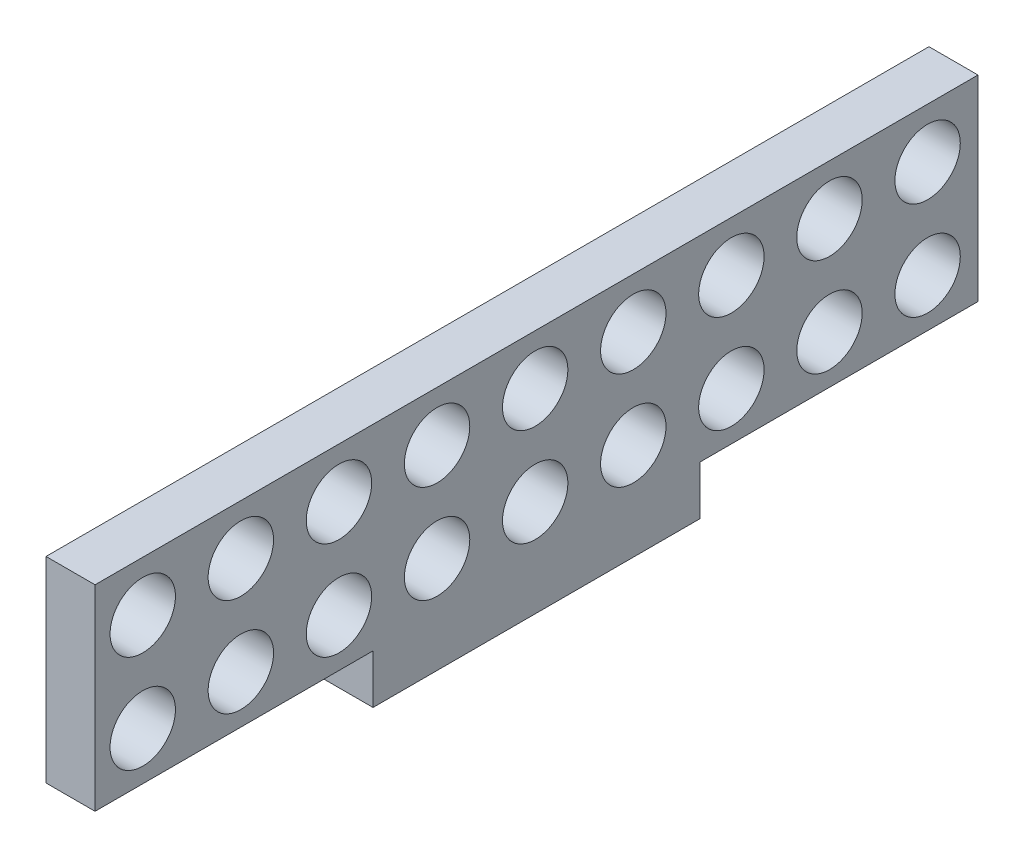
ISO-10303-21;
HEADER;
FILE_DESCRIPTION(('STEP AP214'),'2;1');
FILE_NAME('part.step','',(''),(''),'','','');
FILE_SCHEMA(('AUTOMOTIVE_DESIGN { 1 0 10303 214 1 1 1 1 }'));
ENDSEC;
DATA;
#1=APPLICATION_CONTEXT('core data for automotive mechanical design processes');
#2=APPLICATION_PROTOCOL_DEFINITION('international standard','automotive_design',2000,#1);
#3=PRODUCT_CONTEXT('',#1,'mechanical');
#4=PRODUCT('Part','Part','',(#3));
#5=PRODUCT_RELATED_PRODUCT_CATEGORY('part','',(#4));
#6=PRODUCT_DEFINITION_FORMATION('','',#4);
#7=PRODUCT_DEFINITION_CONTEXT('part definition',#1,'design');
#8=PRODUCT_DEFINITION('design','',#6,#7);
#9=PRODUCT_DEFINITION_SHAPE('','',#8);
#10=(LENGTH_UNIT() NAMED_UNIT(*) SI_UNIT(.MILLI.,.METRE.));
#11=(NAMED_UNIT(*) PLANE_ANGLE_UNIT() SI_UNIT($,.RADIAN.));
#12=(NAMED_UNIT(*) SI_UNIT($,.STERADIAN.) SOLID_ANGLE_UNIT());
#13=UNCERTAINTY_MEASURE_WITH_UNIT(LENGTH_MEASURE(1.E-05),#10,'distance_accuracy_value','');
#14=(GEOMETRIC_REPRESENTATION_CONTEXT(3) GLOBAL_UNCERTAINTY_ASSIGNED_CONTEXT((#13)) GLOBAL_UNIT_ASSIGNED_CONTEXT((#10,
#11,#12)) REPRESENTATION_CONTEXT('',''));
#15=CARTESIAN_POINT('',(0.,0.,0.));
#16=DIRECTION('',(0.,0.,1.));
#17=DIRECTION('',(1.,0.,0.));
#18=AXIS2_PLACEMENT_3D('',#15,#16,#17);
#19=CARTESIAN_POINT('',(3.,7.94312425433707,32.3960362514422));
#20=DIRECTION('',(1.,0.,0.));
#21=DIRECTION('',(0.,0.,-1.));
#22=AXIS2_PLACEMENT_3D('',#19,#20,#21);
#23=PLANE('',#22);
#24=CARTESIAN_POINT('',(3.,4.87641659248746,77.4786925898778));
#25=DIRECTION('',(1.,0.,0.));
#26=DIRECTION('',(0.,0.,-1.));
#27=AXIS2_PLACEMENT_3D('',#24,#25,#26);
#28=CIRCLE('',#27,2.);
#29=CARTESIAN_POINT('',(3.,4.87641659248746,75.4786925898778));
#30=VERTEX_POINT('',#29);
#31=EDGE_CURVE('E272',#30,#30,#28,.T.);
#32=ORIENTED_EDGE('',*,*,#31,.F.);
#33=EDGE_LOOP('',(#32));
#34=FACE_BOUND('',#33,.T.);
#35=CARTESIAN_POINT('',(3.,4.87641659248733,65.4786925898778));
#36=DIRECTION('',(1.,0.,0.));
#37=DIRECTION('',(0.,0.,-1.));
#38=AXIS2_PLACEMENT_3D('',#35,#36,#37);
#39=CIRCLE('',#38,2.);
#40=CARTESIAN_POINT('',(3.,4.87641659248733,63.4786925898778));
#41=VERTEX_POINT('',#40);
#42=EDGE_CURVE('E260',#41,#41,#39,.T.);
#43=ORIENTED_EDGE('',*,*,#42,.F.);
#44=EDGE_LOOP('',(#43));
#45=FACE_BOUND('',#44,.T.);
#46=CARTESIAN_POINT('',(3.,4.87641659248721,53.4786925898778));
#47=DIRECTION('',(1.,0.,0.));
#48=DIRECTION('',(0.,0.,-1.));
#49=AXIS2_PLACEMENT_3D('',#46,#47,#48);
#50=CIRCLE('',#49,2.);
#51=CARTESIAN_POINT('',(3.,4.87641659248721,51.4786925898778));
#52=VERTEX_POINT('',#51);
#53=EDGE_CURVE('E248',#52,#52,#50,.T.);
#54=ORIENTED_EDGE('',*,*,#53,.F.);
#55=EDGE_LOOP('',(#54));
#56=FACE_BOUND('',#55,.T.);
#57=CARTESIAN_POINT('',(3.,4.87641659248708,41.4786925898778));
#58=DIRECTION('',(1.,0.,0.));
#59=DIRECTION('',(0.,0.,-1.));
#60=AXIS2_PLACEMENT_3D('',#57,#58,#59);
#61=CIRCLE('',#60,2.);
#62=CARTESIAN_POINT('',(3.,4.87641659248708,39.4786925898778));
#63=VERTEX_POINT('',#62);
#64=EDGE_CURVE('E236',#63,#63,#61,.T.);
#65=ORIENTED_EDGE('',*,*,#64,.F.);
#66=EDGE_LOOP('',(#65));
#67=FACE_BOUND('',#66,.T.);
#68=CARTESIAN_POINT('',(3.,-1.12358340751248,83.4786925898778));
#69=DIRECTION('',(1.,0.,0.));
#70=DIRECTION('',(0.,0.,-1.));
#71=AXIS2_PLACEMENT_3D('',#68,#69,#70);
#72=CIRCLE('',#71,2.);
#73=CARTESIAN_POINT('',(3.,-1.12358340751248,81.4786925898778));
#74=VERTEX_POINT('',#73);
#75=EDGE_CURVE('E224',#74,#74,#72,.T.);
#76=ORIENTED_EDGE('',*,*,#75,.F.);
#77=EDGE_LOOP('',(#76));
#78=FACE_BOUND('',#77,.T.);
#79=CARTESIAN_POINT('',(3.,-1.12358340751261,71.4786925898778));
#80=DIRECTION('',(1.,0.,0.));
#81=DIRECTION('',(0.,0.,-1.));
#82=AXIS2_PLACEMENT_3D('',#79,#80,#81);
#83=CIRCLE('',#82,2.);
#84=CARTESIAN_POINT('',(3.,-1.12358340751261,69.4786925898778));
#85=VERTEX_POINT('',#84);
#86=EDGE_CURVE('E212',#85,#85,#83,.T.);
#87=ORIENTED_EDGE('',*,*,#86,.F.);
#88=EDGE_LOOP('',(#87));
#89=FACE_BOUND('',#88,.T.);
#90=CARTESIAN_POINT('',(3.,-1.12358340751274,59.4786925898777));
#91=DIRECTION('',(1.,0.,0.));
#92=DIRECTION('',(0.,0.,-1.));
#93=AXIS2_PLACEMENT_3D('',#90,#91,#92);
#94=CIRCLE('',#93,2.);
#95=CARTESIAN_POINT('',(3.,-1.12358340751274,57.4786925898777));
#96=VERTEX_POINT('',#95);
#97=EDGE_CURVE('E200',#96,#96,#94,.T.);
#98=ORIENTED_EDGE('',*,*,#97,.F.);
#99=EDGE_LOOP('',(#98));
#100=FACE_BOUND('',#99,.T.);
#101=CARTESIAN_POINT('',(3.,-1.12358340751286,47.4786925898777));
#102=DIRECTION('',(1.,0.,0.));
#103=DIRECTION('',(0.,0.,-1.));
#104=AXIS2_PLACEMENT_3D('',#101,#102,#103);
#105=CIRCLE('',#104,2.);
#106=CARTESIAN_POINT('',(3.,-1.12358340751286,45.4786925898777));
#107=VERTEX_POINT('',#106);
#108=EDGE_CURVE('E188',#107,#107,#105,.T.);
#109=ORIENTED_EDGE('',*,*,#108,.F.);
#110=EDGE_LOOP('',(#109));
#111=FACE_BOUND('',#110,.T.);
#112=CARTESIAN_POINT('',(3.,-1.12358340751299,35.4786925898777));
#113=DIRECTION('',(1.,0.,0.));
#114=DIRECTION('',(0.,0.,-1.));
#115=AXIS2_PLACEMENT_3D('',#112,#113,#114);
#116=CIRCLE('',#115,2.);
#117=CARTESIAN_POINT('',(3.,-1.12358340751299,33.4786925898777));
#118=VERTEX_POINT('',#117);
#119=EDGE_CURVE('E134',#118,#118,#116,.T.);
#120=ORIENTED_EDGE('',*,*,#119,.F.);
#121=EDGE_LOOP('',(#120));
#122=FACE_BOUND('',#121,.T.);
#123=DIRECTION('',(0.,1.,0.));
#124=VECTOR('',#123,1.);
#125=CARTESIAN_POINT('',(3.,-4.05687574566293,32.3960362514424));
#126=LINE('',#125,#124);
#127=CARTESIAN_POINT('',(3.,-4.05687574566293,32.3960362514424));
#128=VERTEX_POINT('',#127);
#129=CARTESIAN_POINT('',(3.,7.94312425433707,32.3960362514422));
#130=VERTEX_POINT('',#129);
#131=EDGE_CURVE('E145',#128,#130,#126,.T.);
#132=ORIENTED_EDGE('',*,*,#131,.T.);
#133=DIRECTION('',(0.,0.,1.));
#134=VECTOR('',#133,1.);
#135=CARTESIAN_POINT('',(3.,7.94312425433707,32.3960362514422));
#136=LINE('',#135,#134);
#137=CARTESIAN_POINT('',(3.,7.94312425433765,86.3960362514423));
#138=VERTEX_POINT('',#137);
#139=EDGE_CURVE('E93',#130,#138,#136,.T.);
#140=ORIENTED_EDGE('',*,*,#139,.T.);
#141=DIRECTION('',(0.,-1.,0.));
#142=VECTOR('',#141,1.);
#143=CARTESIAN_POINT('',(3.,-4.05687574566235,86.3960362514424));
#144=LINE('',#143,#142);
#145=CARTESIAN_POINT('',(3.,-4.05687574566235,86.3960362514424));
#146=VERTEX_POINT('',#145);
#147=EDGE_CURVE('E160',#138,#146,#144,.T.);
#148=ORIENTED_EDGE('',*,*,#147,.T.);
#149=DIRECTION('',(0.,0.,-1.));
#150=VECTOR('',#149,1.);
#151=CARTESIAN_POINT('',(3.,-4.05687574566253,69.3960362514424));
#152=LINE('',#151,#150);
#153=CARTESIAN_POINT('',(3.,-4.05687574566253,69.3960362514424));
#154=VERTEX_POINT('',#153);
#155=EDGE_CURVE('E173',#146,#154,#152,.T.);
#156=ORIENTED_EDGE('',*,*,#155,.T.);
#157=DIRECTION('',(0.,-1.,0.));
#158=VECTOR('',#157,1.);
#159=CARTESIAN_POINT('',(3.,-7.05687574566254,69.3960362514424));
#160=LINE('',#159,#158);
#161=CARTESIAN_POINT('',(3.,-7.05687574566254,69.3960362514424));
#162=VERTEX_POINT('',#161);
#163=EDGE_CURVE('E112',#154,#162,#160,.T.);
#164=ORIENTED_EDGE('',*,*,#163,.T.);
#165=DIRECTION('',(0.,0.,-1.));
#166=VECTOR('',#165,1.);
#167=CARTESIAN_POINT('',(3.,-7.05687574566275,49.3960362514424));
#168=LINE('',#167,#166);
#169=CARTESIAN_POINT('',(3.,-7.05687574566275,49.3960362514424));
#170=VERTEX_POINT('',#169);
#171=EDGE_CURVE('E106',#162,#170,#168,.T.);
#172=ORIENTED_EDGE('',*,*,#171,.T.);
#173=DIRECTION('',(0.,1.,0.));
#174=VECTOR('',#173,1.);
#175=CARTESIAN_POINT('',(3.,-7.05687574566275,49.3960362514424));
#176=LINE('',#175,#174);
#177=CARTESIAN_POINT('',(3.,-4.05687574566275,49.3960362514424));
#178=VERTEX_POINT('',#177);
#179=EDGE_CURVE('E110',#170,#178,#176,.T.);
#180=ORIENTED_EDGE('',*,*,#179,.T.);
#181=DIRECTION('',(0.,0.,-1.));
#182=VECTOR('',#181,1.);
#183=CARTESIAN_POINT('',(3.,-4.05687574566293,32.3960362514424));
#184=LINE('',#183,#182);
#185=EDGE_CURVE('E50',#178,#128,#184,.T.);
#186=ORIENTED_EDGE('',*,*,#185,.T.);
#187=EDGE_LOOP('',(#132,#140,#148,#156,#164,#172,#180,#186));
#188=FACE_BOUND('',#187,.T.);
#189=CARTESIAN_POINT('',(3.,-1.12358340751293,41.4786925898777));
#190=DIRECTION('',(1.,0.,0.));
#191=DIRECTION('',(0.,0.,-1.));
#192=AXIS2_PLACEMENT_3D('',#189,#190,#191);
#193=CIRCLE('',#192,2.);
#194=CARTESIAN_POINT('',(3.,-1.12358340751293,39.4786925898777));
#195=VERTEX_POINT('',#194);
#196=EDGE_CURVE('E182',#195,#195,#193,.T.);
#197=ORIENTED_EDGE('',*,*,#196,.F.);
#198=EDGE_LOOP('',(#197));
#199=FACE_BOUND('',#198,.T.);
#200=CARTESIAN_POINT('',(3.,-1.1235834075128,53.4786925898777));
#201=DIRECTION('',(1.,0.,0.));
#202=DIRECTION('',(0.,0.,-1.));
#203=AXIS2_PLACEMENT_3D('',#200,#201,#202);
#204=CIRCLE('',#203,2.);
#205=CARTESIAN_POINT('',(3.,-1.1235834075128,51.4786925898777));
#206=VERTEX_POINT('',#205);
#207=EDGE_CURVE('E194',#206,#206,#204,.T.);
#208=ORIENTED_EDGE('',*,*,#207,.F.);
#209=EDGE_LOOP('',(#208));
#210=FACE_BOUND('',#209,.T.);
#211=CARTESIAN_POINT('',(3.,-1.12358340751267,65.4786925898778));
#212=DIRECTION('',(1.,0.,0.));
#213=DIRECTION('',(0.,0.,-1.));
#214=AXIS2_PLACEMENT_3D('',#211,#212,#213);
#215=CIRCLE('',#214,2.);
#216=CARTESIAN_POINT('',(3.,-1.12358340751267,63.4786925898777));
#217=VERTEX_POINT('',#216);
#218=EDGE_CURVE('E206',#217,#217,#215,.T.);
#219=ORIENTED_EDGE('',*,*,#218,.F.);
#220=EDGE_LOOP('',(#219));
#221=FACE_BOUND('',#220,.T.);
#222=CARTESIAN_POINT('',(3.,-1.12358340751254,77.4786925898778));
#223=DIRECTION('',(1.,0.,0.));
#224=DIRECTION('',(0.,0.,-1.));
#225=AXIS2_PLACEMENT_3D('',#222,#223,#224);
#226=CIRCLE('',#225,2.);
#227=CARTESIAN_POINT('',(3.,-1.12358340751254,75.4786925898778));
#228=VERTEX_POINT('',#227);
#229=EDGE_CURVE('E218',#228,#228,#226,.T.);
#230=ORIENTED_EDGE('',*,*,#229,.F.);
#231=EDGE_LOOP('',(#230));
#232=FACE_BOUND('',#231,.T.);
#233=CARTESIAN_POINT('',(3.,4.87641659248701,35.4786925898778));
#234=DIRECTION('',(1.,0.,0.));
#235=DIRECTION('',(0.,0.,-1.));
#236=AXIS2_PLACEMENT_3D('',#233,#234,#235);
#237=CIRCLE('',#236,2.);
#238=CARTESIAN_POINT('',(3.,4.87641659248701,33.4786925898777));
#239=VERTEX_POINT('',#238);
#240=EDGE_CURVE('E230',#239,#239,#237,.T.);
#241=ORIENTED_EDGE('',*,*,#240,.F.);
#242=EDGE_LOOP('',(#241));
#243=FACE_BOUND('',#242,.T.);
#244=CARTESIAN_POINT('',(3.,4.87641659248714,47.4786925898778));
#245=DIRECTION('',(1.,0.,0.));
#246=DIRECTION('',(0.,0.,-1.));
#247=AXIS2_PLACEMENT_3D('',#244,#245,#246);
#248=CIRCLE('',#247,2.);
#249=CARTESIAN_POINT('',(3.,4.87641659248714,45.4786925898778));
#250=VERTEX_POINT('',#249);
#251=EDGE_CURVE('E242',#250,#250,#248,.T.);
#252=ORIENTED_EDGE('',*,*,#251,.F.);
#253=EDGE_LOOP('',(#252));
#254=FACE_BOUND('',#253,.T.);
#255=CARTESIAN_POINT('',(3.,4.87641659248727,59.4786925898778));
#256=DIRECTION('',(1.,0.,0.));
#257=DIRECTION('',(0.,0.,-1.));
#258=AXIS2_PLACEMENT_3D('',#255,#256,#257);
#259=CIRCLE('',#258,2.);
#260=CARTESIAN_POINT('',(3.,4.87641659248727,57.4786925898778));
#261=VERTEX_POINT('',#260);
#262=EDGE_CURVE('E254',#261,#261,#259,.T.);
#263=ORIENTED_EDGE('',*,*,#262,.F.);
#264=EDGE_LOOP('',(#263));
#265=FACE_BOUND('',#264,.T.);
#266=CARTESIAN_POINT('',(3.,4.8764165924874,71.4786925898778));
#267=DIRECTION('',(1.,0.,0.));
#268=DIRECTION('',(0.,0.,-1.));
#269=AXIS2_PLACEMENT_3D('',#266,#267,#268);
#270=CIRCLE('',#269,2.);
#271=CARTESIAN_POINT('',(3.,4.8764165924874,69.4786925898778));
#272=VERTEX_POINT('',#271);
#273=EDGE_CURVE('E266',#272,#272,#270,.T.);
#274=ORIENTED_EDGE('',*,*,#273,.F.);
#275=EDGE_LOOP('',(#274));
#276=FACE_BOUND('',#275,.T.);
#277=CARTESIAN_POINT('',(3.,4.87641659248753,83.4786925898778));
#278=DIRECTION('',(1.,0.,0.));
#279=DIRECTION('',(0.,0.,-1.));
#280=AXIS2_PLACEMENT_3D('',#277,#278,#279);
#281=CIRCLE('',#280,2.);
#282=CARTESIAN_POINT('',(3.,4.87641659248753,81.4786925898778));
#283=VERTEX_POINT('',#282);
#284=EDGE_CURVE('E278',#283,#283,#281,.T.);
#285=ORIENTED_EDGE('',*,*,#284,.F.);
#286=EDGE_LOOP('',(#285));
#287=FACE_BOUND('',#286,.T.);
#288=ADVANCED_FACE('F33',(#34,#45,#56,#67,#78,#89,#100,#111,#122,#188,#199,#210,#221,#232,#243,
#254,#265,#276,#287),#23,.T.);
#289=CARTESIAN_POINT('',(0.,7.94312425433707,32.3960362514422));
#290=DIRECTION('',(1.,0.,0.));
#291=DIRECTION('',(0.,0.,-1.));
#292=AXIS2_PLACEMENT_3D('',#289,#290,#291);
#293=PLANE('',#292);
#294=CARTESIAN_POINT('',(0.,4.87641659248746,77.4786925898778));
#295=DIRECTION('',(1.,0.,0.));
#296=DIRECTION('',(0.,0.,-1.));
#297=AXIS2_PLACEMENT_3D('',#294,#295,#296);
#298=CIRCLE('',#297,2.);
#299=CARTESIAN_POINT('',(0.,4.87641659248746,75.4786925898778));
#300=VERTEX_POINT('',#299);
#301=EDGE_CURVE('E275',#300,#300,#298,.T.);
#302=ORIENTED_EDGE('',*,*,#301,.T.);
#303=EDGE_LOOP('',(#302));
#304=FACE_BOUND('',#303,.T.);
#305=CARTESIAN_POINT('',(0.,4.87641659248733,65.4786925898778));
#306=DIRECTION('',(1.,0.,0.));
#307=DIRECTION('',(0.,0.,-1.));
#308=AXIS2_PLACEMENT_3D('',#305,#306,#307);
#309=CIRCLE('',#308,2.);
#310=CARTESIAN_POINT('',(0.,4.87641659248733,63.4786925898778));
#311=VERTEX_POINT('',#310);
#312=EDGE_CURVE('E263',#311,#311,#309,.T.);
#313=ORIENTED_EDGE('',*,*,#312,.T.);
#314=EDGE_LOOP('',(#313));
#315=FACE_BOUND('',#314,.T.);
#316=CARTESIAN_POINT('',(0.,4.87641659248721,53.4786925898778));
#317=DIRECTION('',(1.,0.,0.));
#318=DIRECTION('',(0.,0.,-1.));
#319=AXIS2_PLACEMENT_3D('',#316,#317,#318);
#320=CIRCLE('',#319,2.);
#321=CARTESIAN_POINT('',(0.,4.87641659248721,51.4786925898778));
#322=VERTEX_POINT('',#321);
#323=EDGE_CURVE('E251',#322,#322,#320,.T.);
#324=ORIENTED_EDGE('',*,*,#323,.T.);
#325=EDGE_LOOP('',(#324));
#326=FACE_BOUND('',#325,.T.);
#327=CARTESIAN_POINT('',(0.,4.87641659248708,41.4786925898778));
#328=DIRECTION('',(1.,0.,0.));
#329=DIRECTION('',(0.,0.,-1.));
#330=AXIS2_PLACEMENT_3D('',#327,#328,#329);
#331=CIRCLE('',#330,2.);
#332=CARTESIAN_POINT('',(0.,4.87641659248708,39.4786925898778));
#333=VERTEX_POINT('',#332);
#334=EDGE_CURVE('E239',#333,#333,#331,.T.);
#335=ORIENTED_EDGE('',*,*,#334,.T.);
#336=EDGE_LOOP('',(#335));
#337=FACE_BOUND('',#336,.T.);
#338=CARTESIAN_POINT('',(0.,-1.12358340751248,83.4786925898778));
#339=DIRECTION('',(1.,0.,0.));
#340=DIRECTION('',(0.,0.,-1.));
#341=AXIS2_PLACEMENT_3D('',#338,#339,#340);
#342=CIRCLE('',#341,2.);
#343=CARTESIAN_POINT('',(0.,-1.12358340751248,81.4786925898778));
#344=VERTEX_POINT('',#343);
#345=EDGE_CURVE('E227',#344,#344,#342,.T.);
#346=ORIENTED_EDGE('',*,*,#345,.T.);
#347=EDGE_LOOP('',(#346));
#348=FACE_BOUND('',#347,.T.);
#349=CARTESIAN_POINT('',(0.,-1.12358340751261,71.4786925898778));
#350=DIRECTION('',(1.,0.,0.));
#351=DIRECTION('',(0.,0.,-1.));
#352=AXIS2_PLACEMENT_3D('',#349,#350,#351);
#353=CIRCLE('',#352,2.);
#354=CARTESIAN_POINT('',(0.,-1.12358340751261,69.4786925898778));
#355=VERTEX_POINT('',#354);
#356=EDGE_CURVE('E215',#355,#355,#353,.T.);
#357=ORIENTED_EDGE('',*,*,#356,.T.);
#358=EDGE_LOOP('',(#357));
#359=FACE_BOUND('',#358,.T.);
#360=CARTESIAN_POINT('',(0.,-1.12358340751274,59.4786925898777));
#361=DIRECTION('',(1.,0.,0.));
#362=DIRECTION('',(0.,0.,-1.));
#363=AXIS2_PLACEMENT_3D('',#360,#361,#362);
#364=CIRCLE('',#363,2.);
#365=CARTESIAN_POINT('',(0.,-1.12358340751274,57.4786925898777));
#366=VERTEX_POINT('',#365);
#367=EDGE_CURVE('E203',#366,#366,#364,.T.);
#368=ORIENTED_EDGE('',*,*,#367,.T.);
#369=EDGE_LOOP('',(#368));
#370=FACE_BOUND('',#369,.T.);
#371=CARTESIAN_POINT('',(0.,-1.12358340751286,47.4786925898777));
#372=DIRECTION('',(1.,0.,0.));
#373=DIRECTION('',(0.,0.,-1.));
#374=AXIS2_PLACEMENT_3D('',#371,#372,#373);
#375=CIRCLE('',#374,2.);
#376=CARTESIAN_POINT('',(0.,-1.12358340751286,45.4786925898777));
#377=VERTEX_POINT('',#376);
#378=EDGE_CURVE('E191',#377,#377,#375,.T.);
#379=ORIENTED_EDGE('',*,*,#378,.T.);
#380=EDGE_LOOP('',(#379));
#381=FACE_BOUND('',#380,.T.);
#382=CARTESIAN_POINT('',(0.,-1.12358340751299,35.4786925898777));
#383=DIRECTION('',(1.,0.,0.));
#384=DIRECTION('',(0.,0.,-1.));
#385=AXIS2_PLACEMENT_3D('',#382,#383,#384);
#386=CIRCLE('',#385,2.);
#387=CARTESIAN_POINT('',(0.,-1.12358340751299,33.4786925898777));
#388=VERTEX_POINT('',#387);
#389=EDGE_CURVE('E179',#388,#388,#386,.T.);
#390=ORIENTED_EDGE('',*,*,#389,.T.);
#391=EDGE_LOOP('',(#390));
#392=FACE_BOUND('',#391,.T.);
#393=DIRECTION('',(0.,1.,0.));
#394=VECTOR('',#393,1.);
#395=CARTESIAN_POINT('',(0.,-4.05687574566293,32.3960362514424));
#396=LINE('',#395,#394);
#397=CARTESIAN_POINT('',(0.,-4.05687574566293,32.3960362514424));
#398=VERTEX_POINT('',#397);
#399=CARTESIAN_POINT('',(0.,7.94312425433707,32.3960362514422));
#400=VERTEX_POINT('',#399);
#401=EDGE_CURVE('E130',#398,#400,#396,.T.);
#402=ORIENTED_EDGE('',*,*,#401,.F.);
#403=DIRECTION('',(0.,0.,-1.));
#404=VECTOR('',#403,1.);
#405=CARTESIAN_POINT('',(0.,-4.05687574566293,32.3960362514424));
#406=LINE('',#405,#404);
#407=CARTESIAN_POINT('',(0.,-4.05687574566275,49.3960362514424));
#408=VERTEX_POINT('',#407);
#409=EDGE_CURVE('E85',#408,#398,#406,.T.);
#410=ORIENTED_EDGE('',*,*,#409,.F.);
#411=DIRECTION('',(0.,1.,0.));
#412=VECTOR('',#411,1.);
#413=CARTESIAN_POINT('',(0.,-7.05687574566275,49.3960362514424));
#414=LINE('',#413,#412);
#415=CARTESIAN_POINT('',(0.,-7.05687574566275,49.3960362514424));
#416=VERTEX_POINT('',#415);
#417=EDGE_CURVE('E79',#416,#408,#414,.T.);
#418=ORIENTED_EDGE('',*,*,#417,.F.);
#419=DIRECTION('',(0.,0.,-1.));
#420=VECTOR('',#419,1.);
#421=CARTESIAN_POINT('',(0.,-7.05687574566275,49.3960362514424));
#422=LINE('',#421,#420);
#423=CARTESIAN_POINT('',(0.,-7.05687574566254,69.3960362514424));
#424=VERTEX_POINT('',#423);
#425=EDGE_CURVE('E120',#424,#416,#422,.T.);
#426=ORIENTED_EDGE('',*,*,#425,.F.);
#427=DIRECTION('',(0.,-1.,0.));
#428=VECTOR('',#427,1.);
#429=CARTESIAN_POINT('',(0.,-7.05687574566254,69.3960362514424));
#430=LINE('',#429,#428);
#431=CARTESIAN_POINT('',(0.,-4.05687574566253,69.3960362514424));
#432=VERTEX_POINT('',#431);
#433=EDGE_CURVE('E140',#432,#424,#430,.T.);
#434=ORIENTED_EDGE('',*,*,#433,.F.);
#435=DIRECTION('',(0.,0.,-1.));
#436=VECTOR('',#435,1.);
#437=CARTESIAN_POINT('',(0.,-4.05687574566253,69.3960362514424));
#438=LINE('',#437,#436);
#439=CARTESIAN_POINT('',(0.,-4.05687574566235,86.3960362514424));
#440=VERTEX_POINT('',#439);
#441=EDGE_CURVE('E138',#440,#432,#438,.T.);
#442=ORIENTED_EDGE('',*,*,#441,.F.);
#443=DIRECTION('',(0.,-1.,0.));
#444=VECTOR('',#443,1.);
#445=CARTESIAN_POINT('',(0.,-4.05687574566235,86.3960362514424));
#446=LINE('',#445,#444);
#447=CARTESIAN_POINT('',(0.,7.94312425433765,86.3960362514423));
#448=VERTEX_POINT('',#447);
#449=EDGE_CURVE('E136',#448,#440,#446,.T.);
#450=ORIENTED_EDGE('',*,*,#449,.F.);
#451=DIRECTION('',(0.,0.,1.));
#452=VECTOR('',#451,1.);
#453=CARTESIAN_POINT('',(0.,7.94312425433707,32.3960362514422));
#454=LINE('',#453,#452);
#455=EDGE_CURVE('E133',#400,#448,#454,.T.);
#456=ORIENTED_EDGE('',*,*,#455,.F.);
#457=EDGE_LOOP('',(#402,#410,#418,#426,#434,#442,#450,#456));
#458=FACE_BOUND('',#457,.T.);
#459=CARTESIAN_POINT('',(0.,-1.12358340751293,41.4786925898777));
#460=DIRECTION('',(1.,0.,0.));
#461=DIRECTION('',(0.,0.,-1.));
#462=AXIS2_PLACEMENT_3D('',#459,#460,#461);
#463=CIRCLE('',#462,2.);
#464=CARTESIAN_POINT('',(0.,-1.12358340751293,39.4786925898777));
#465=VERTEX_POINT('',#464);
#466=EDGE_CURVE('E185',#465,#465,#463,.T.);
#467=ORIENTED_EDGE('',*,*,#466,.T.);
#468=EDGE_LOOP('',(#467));
#469=FACE_BOUND('',#468,.T.);
#470=CARTESIAN_POINT('',(0.,-1.1235834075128,53.4786925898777));
#471=DIRECTION('',(1.,0.,0.));
#472=DIRECTION('',(0.,0.,-1.));
#473=AXIS2_PLACEMENT_3D('',#470,#471,#472);
#474=CIRCLE('',#473,2.);
#475=CARTESIAN_POINT('',(0.,-1.1235834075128,51.4786925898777));
#476=VERTEX_POINT('',#475);
#477=EDGE_CURVE('E197',#476,#476,#474,.T.);
#478=ORIENTED_EDGE('',*,*,#477,.T.);
#479=EDGE_LOOP('',(#478));
#480=FACE_BOUND('',#479,.T.);
#481=CARTESIAN_POINT('',(0.,-1.12358340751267,65.4786925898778));
#482=DIRECTION('',(1.,0.,0.));
#483=DIRECTION('',(0.,0.,-1.));
#484=AXIS2_PLACEMENT_3D('',#481,#482,#483);
#485=CIRCLE('',#484,2.);
#486=CARTESIAN_POINT('',(0.,-1.12358340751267,63.4786925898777));
#487=VERTEX_POINT('',#486);
#488=EDGE_CURVE('E209',#487,#487,#485,.T.);
#489=ORIENTED_EDGE('',*,*,#488,.T.);
#490=EDGE_LOOP('',(#489));
#491=FACE_BOUND('',#490,.T.);
#492=CARTESIAN_POINT('',(0.,-1.12358340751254,77.4786925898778));
#493=DIRECTION('',(1.,0.,0.));
#494=DIRECTION('',(0.,0.,-1.));
#495=AXIS2_PLACEMENT_3D('',#492,#493,#494);
#496=CIRCLE('',#495,2.);
#497=CARTESIAN_POINT('',(0.,-1.12358340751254,75.4786925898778));
#498=VERTEX_POINT('',#497);
#499=EDGE_CURVE('E221',#498,#498,#496,.T.);
#500=ORIENTED_EDGE('',*,*,#499,.T.);
#501=EDGE_LOOP('',(#500));
#502=FACE_BOUND('',#501,.T.);
#503=CARTESIAN_POINT('',(0.,4.87641659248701,35.4786925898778));
#504=DIRECTION('',(1.,0.,0.));
#505=DIRECTION('',(0.,0.,-1.));
#506=AXIS2_PLACEMENT_3D('',#503,#504,#505);
#507=CIRCLE('',#506,2.);
#508=CARTESIAN_POINT('',(0.,4.87641659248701,33.4786925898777));
#509=VERTEX_POINT('',#508);
#510=EDGE_CURVE('E233',#509,#509,#507,.T.);
#511=ORIENTED_EDGE('',*,*,#510,.T.);
#512=EDGE_LOOP('',(#511));
#513=FACE_BOUND('',#512,.T.);
#514=CARTESIAN_POINT('',(0.,4.87641659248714,47.4786925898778));
#515=DIRECTION('',(1.,0.,0.));
#516=DIRECTION('',(0.,0.,-1.));
#517=AXIS2_PLACEMENT_3D('',#514,#515,#516);
#518=CIRCLE('',#517,2.);
#519=CARTESIAN_POINT('',(0.,4.87641659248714,45.4786925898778));
#520=VERTEX_POINT('',#519);
#521=EDGE_CURVE('E245',#520,#520,#518,.T.);
#522=ORIENTED_EDGE('',*,*,#521,.T.);
#523=EDGE_LOOP('',(#522));
#524=FACE_BOUND('',#523,.T.);
#525=CARTESIAN_POINT('',(0.,4.87641659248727,59.4786925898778));
#526=DIRECTION('',(1.,0.,0.));
#527=DIRECTION('',(0.,0.,-1.));
#528=AXIS2_PLACEMENT_3D('',#525,#526,#527);
#529=CIRCLE('',#528,2.);
#530=CARTESIAN_POINT('',(0.,4.87641659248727,57.4786925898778));
#531=VERTEX_POINT('',#530);
#532=EDGE_CURVE('E257',#531,#531,#529,.T.);
#533=ORIENTED_EDGE('',*,*,#532,.T.);
#534=EDGE_LOOP('',(#533));
#535=FACE_BOUND('',#534,.T.);
#536=CARTESIAN_POINT('',(0.,4.8764165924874,71.4786925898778));
#537=DIRECTION('',(1.,0.,0.));
#538=DIRECTION('',(0.,0.,-1.));
#539=AXIS2_PLACEMENT_3D('',#536,#537,#538);
#540=CIRCLE('',#539,2.);
#541=CARTESIAN_POINT('',(0.,4.8764165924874,69.4786925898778));
#542=VERTEX_POINT('',#541);
#543=EDGE_CURVE('E269',#542,#542,#540,.T.);
#544=ORIENTED_EDGE('',*,*,#543,.T.);
#545=EDGE_LOOP('',(#544));
#546=FACE_BOUND('',#545,.T.);
#547=CARTESIAN_POINT('',(0.,4.87641659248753,83.4786925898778));
#548=DIRECTION('',(1.,0.,0.));
#549=DIRECTION('',(0.,0.,-1.));
#550=AXIS2_PLACEMENT_3D('',#547,#548,#549);
#551=CIRCLE('',#550,2.);
#552=CARTESIAN_POINT('',(0.,4.87641659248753,81.4786925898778));
#553=VERTEX_POINT('',#552);
#554=EDGE_CURVE('E281',#553,#553,#551,.T.);
#555=ORIENTED_EDGE('',*,*,#554,.T.);
#556=EDGE_LOOP('',(#555));
#557=FACE_BOUND('',#556,.T.);
#558=ADVANCED_FACE('F164',(#304,#315,#326,#337,#348,#359,#370,#381,#392,#458,#469,#480,#491,
#502,#513,#524,#535,#546,#557),#293,.F.);
#559=CARTESIAN_POINT('',(3.,-4.05687574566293,32.3960362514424));
#560=DIRECTION('',(0.,0.,1.));
#561=DIRECTION('',(0.,-1.,0.));
#562=AXIS2_PLACEMENT_3D('',#559,#560,#561);
#563=PLANE('',#562);
#564=ORIENTED_EDGE('',*,*,#401,.T.);
#565=DIRECTION('',(-1.,0.,0.));
#566=VECTOR('',#565,1.);
#567=CARTESIAN_POINT('',(3.,7.94312425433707,32.3960362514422));
#568=LINE('',#567,#566);
#569=EDGE_CURVE('E11',#130,#400,#568,.T.);
#570=ORIENTED_EDGE('',*,*,#569,.F.);
#571=ORIENTED_EDGE('',*,*,#131,.F.);
#572=DIRECTION('',(-1.,0.,0.));
#573=VECTOR('',#572,1.);
#574=CARTESIAN_POINT('',(3.,-4.05687574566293,32.3960362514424));
#575=LINE('',#574,#573);
#576=EDGE_CURVE('E126',#128,#398,#575,.T.);
#577=ORIENTED_EDGE('',*,*,#576,.T.);
#578=EDGE_LOOP('',(#564,#570,#571,#577));
#579=FACE_BOUND('',#578,.T.);
#580=ADVANCED_FACE('F35',(#579),#563,.F.);
#581=CARTESIAN_POINT('',(3.,7.94312425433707,32.3960362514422));
#582=DIRECTION('',(0.,-1.,0.));
#583=DIRECTION('',(0.,0.,-1.));
#584=AXIS2_PLACEMENT_3D('',#581,#582,#583);
#585=PLANE('',#584);
#586=ORIENTED_EDGE('',*,*,#455,.T.);
#587=DIRECTION('',(-1.,0.,0.));
#588=VECTOR('',#587,1.);
#589=CARTESIAN_POINT('',(3.,7.94312425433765,86.3960362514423));
#590=LINE('',#589,#588);
#591=EDGE_CURVE('E42',#138,#448,#590,.T.);
#592=ORIENTED_EDGE('',*,*,#591,.F.);
#593=ORIENTED_EDGE('',*,*,#139,.F.);
#594=ORIENTED_EDGE('',*,*,#569,.T.);
#595=EDGE_LOOP('',(#586,#592,#593,#594));
#596=FACE_BOUND('',#595,.T.);
#597=ADVANCED_FACE('F316',(#596),#585,.F.);
#598=CARTESIAN_POINT('',(3.,-4.05687574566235,86.3960362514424));
#599=DIRECTION('',(0.,0.,-1.));
#600=DIRECTION('',(0.,1.,0.));
#601=AXIS2_PLACEMENT_3D('',#598,#599,#600);
#602=PLANE('',#601);
#603=ORIENTED_EDGE('',*,*,#449,.T.);
#604=DIRECTION('',(-1.,0.,0.));
#605=VECTOR('',#604,1.);
#606=CARTESIAN_POINT('',(3.,-4.05687574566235,86.3960362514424));
#607=LINE('',#606,#605);
#608=EDGE_CURVE('E152',#146,#440,#607,.T.);
#609=ORIENTED_EDGE('',*,*,#608,.F.);
#610=ORIENTED_EDGE('',*,*,#147,.F.);
#611=ORIENTED_EDGE('',*,*,#591,.T.);
#612=EDGE_LOOP('',(#603,#609,#610,#611));
#613=FACE_BOUND('',#612,.T.);
#614=ADVANCED_FACE('F158',(#613),#602,.F.);
#615=CARTESIAN_POINT('',(3.,-4.05687574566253,69.3960362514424));
#616=DIRECTION('',(0.,1.,0.));
#617=DIRECTION('',(0.,0.,1.));
#618=AXIS2_PLACEMENT_3D('',#615,#616,#617);
#619=PLANE('',#618);
#620=ORIENTED_EDGE('',*,*,#441,.T.);
#621=DIRECTION('',(-1.,0.,0.));
#622=VECTOR('',#621,1.);
#623=CARTESIAN_POINT('',(3.,-4.05687574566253,69.3960362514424));
#624=LINE('',#623,#622);
#625=EDGE_CURVE('E149',#154,#432,#624,.T.);
#626=ORIENTED_EDGE('',*,*,#625,.F.);
#627=ORIENTED_EDGE('',*,*,#155,.F.);
#628=ORIENTED_EDGE('',*,*,#608,.T.);
#629=EDGE_LOOP('',(#620,#626,#627,#628));
#630=FACE_BOUND('',#629,.T.);
#631=ADVANCED_FACE('F169',(#630),#619,.F.);
#632=CARTESIAN_POINT('',(3.,-7.05687574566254,69.3960362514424));
#633=DIRECTION('',(0.,0.,-1.));
#634=DIRECTION('',(0.,1.,0.));
#635=AXIS2_PLACEMENT_3D('',#632,#633,#634);
#636=PLANE('',#635);
#637=ORIENTED_EDGE('',*,*,#433,.T.);
#638=DIRECTION('',(-1.,0.,0.));
#639=VECTOR('',#638,1.);
#640=CARTESIAN_POINT('',(3.,-7.05687574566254,69.3960362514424));
#641=LINE('',#640,#639);
#642=EDGE_CURVE('E121',#162,#424,#641,.T.);
#643=ORIENTED_EDGE('',*,*,#642,.F.);
#644=ORIENTED_EDGE('',*,*,#163,.F.);
#645=ORIENTED_EDGE('',*,*,#625,.T.);
#646=EDGE_LOOP('',(#637,#643,#644,#645));
#647=FACE_BOUND('',#646,.T.);
#648=ADVANCED_FACE('F172',(#647),#636,.F.);
#649=CARTESIAN_POINT('',(3.,-7.05687574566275,49.3960362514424));
#650=DIRECTION('',(0.,1.,0.));
#651=DIRECTION('',(0.,0.,1.));
#652=AXIS2_PLACEMENT_3D('',#649,#650,#651);
#653=PLANE('',#652);
#654=ORIENTED_EDGE('',*,*,#425,.T.);
#655=DIRECTION('',(-1.,0.,0.));
#656=VECTOR('',#655,1.);
#657=CARTESIAN_POINT('',(3.,-7.05687574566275,49.3960362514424));
#658=LINE('',#657,#656);
#659=EDGE_CURVE('E117',#170,#416,#658,.T.);
#660=ORIENTED_EDGE('',*,*,#659,.F.);
#661=ORIENTED_EDGE('',*,*,#171,.F.);
#662=ORIENTED_EDGE('',*,*,#642,.T.);
#663=EDGE_LOOP('',(#654,#660,#661,#662));
#664=FACE_BOUND('',#663,.T.);
#665=ADVANCED_FACE('F118',(#664),#653,.F.);
#666=CARTESIAN_POINT('',(3.,-7.05687574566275,49.3960362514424));
#667=DIRECTION('',(0.,0.,1.));
#668=DIRECTION('',(0.,-1.,0.));
#669=AXIS2_PLACEMENT_3D('',#666,#667,#668);
#670=PLANE('',#669);
#671=ORIENTED_EDGE('',*,*,#417,.T.);
#672=DIRECTION('',(-1.,0.,0.));
#673=VECTOR('',#672,1.);
#674=CARTESIAN_POINT('',(3.,-4.05687574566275,49.3960362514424));
#675=LINE('',#674,#673);
#676=EDGE_CURVE('E122',#178,#408,#675,.T.);
#677=ORIENTED_EDGE('',*,*,#676,.F.);
#678=ORIENTED_EDGE('',*,*,#179,.F.);
#679=ORIENTED_EDGE('',*,*,#659,.T.);
#680=EDGE_LOOP('',(#671,#677,#678,#679));
#681=FACE_BOUND('',#680,.T.);
#682=ADVANCED_FACE('F124',(#681),#670,.F.);
#683=CARTESIAN_POINT('',(3.,-4.05687574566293,32.3960362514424));
#684=DIRECTION('',(0.,1.,0.));
#685=DIRECTION('',(0.,0.,1.));
#686=AXIS2_PLACEMENT_3D('',#683,#684,#685);
#687=PLANE('',#686);
#688=ORIENTED_EDGE('',*,*,#409,.T.);
#689=ORIENTED_EDGE('',*,*,#576,.F.);
#690=ORIENTED_EDGE('',*,*,#185,.F.);
#691=ORIENTED_EDGE('',*,*,#676,.T.);
#692=EDGE_LOOP('',(#688,#689,#690,#691));
#693=FACE_BOUND('',#692,.T.);
#694=ADVANCED_FACE('F304',(#693),#687,.F.);
#695=CARTESIAN_POINT('',(3.,-1.12358340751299,35.4786925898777));
#696=DIRECTION('',(-1.,0.,0.));
#697=DIRECTION('',(0.,0.,1.));
#698=AXIS2_PLACEMENT_3D('',#695,#696,#697);
#699=CYLINDRICAL_SURFACE('',#698,2.);
#700=ORIENTED_EDGE('',*,*,#119,.T.);
#701=EDGE_LOOP('',(#700));
#702=FACE_BOUND('',#701,.T.);
#703=ORIENTED_EDGE('',*,*,#389,.F.);
#704=EDGE_LOOP('',(#703));
#705=FACE_BOUND('',#704,.T.);
#706=ADVANCED_FACE('F301',(#702,#705),#699,.F.);
#707=CARTESIAN_POINT('',(3.,-1.12358340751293,41.4786925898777));
#708=DIRECTION('',(-1.,0.,0.));
#709=DIRECTION('',(0.,0.,1.));
#710=AXIS2_PLACEMENT_3D('',#707,#708,#709);
#711=CYLINDRICAL_SURFACE('',#710,2.);
#712=ORIENTED_EDGE('',*,*,#196,.T.);
#713=EDGE_LOOP('',(#712));
#714=FACE_BOUND('',#713,.T.);
#715=ORIENTED_EDGE('',*,*,#466,.F.);
#716=EDGE_LOOP('',(#715));
#717=FACE_BOUND('',#716,.T.);
#718=ADVANCED_FACE('F380',(#714,#717),#711,.F.);
#719=CARTESIAN_POINT('',(3.,-1.12358340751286,47.4786925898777));
#720=DIRECTION('',(-1.,0.,0.));
#721=DIRECTION('',(0.,0.,1.));
#722=AXIS2_PLACEMENT_3D('',#719,#720,#721);
#723=CYLINDRICAL_SURFACE('',#722,2.);
#724=ORIENTED_EDGE('',*,*,#108,.T.);
#725=EDGE_LOOP('',(#724));
#726=FACE_BOUND('',#725,.T.);
#727=ORIENTED_EDGE('',*,*,#378,.F.);
#728=EDGE_LOOP('',(#727));
#729=FACE_BOUND('',#728,.T.);
#730=ADVANCED_FACE('F388',(#726,#729),#723,.F.);
#731=CARTESIAN_POINT('',(3.,-1.1235834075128,53.4786925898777));
#732=DIRECTION('',(-1.,0.,0.));
#733=DIRECTION('',(0.,0.,1.));
#734=AXIS2_PLACEMENT_3D('',#731,#732,#733);
#735=CYLINDRICAL_SURFACE('',#734,2.);
#736=ORIENTED_EDGE('',*,*,#207,.T.);
#737=EDGE_LOOP('',(#736));
#738=FACE_BOUND('',#737,.T.);
#739=ORIENTED_EDGE('',*,*,#477,.F.);
#740=EDGE_LOOP('',(#739));
#741=FACE_BOUND('',#740,.T.);
#742=ADVANCED_FACE('F396',(#738,#741),#735,.F.);
#743=CARTESIAN_POINT('',(3.,-1.12358340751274,59.4786925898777));
#744=DIRECTION('',(-1.,0.,0.));
#745=DIRECTION('',(0.,0.,1.));
#746=AXIS2_PLACEMENT_3D('',#743,#744,#745);
#747=CYLINDRICAL_SURFACE('',#746,2.);
#748=ORIENTED_EDGE('',*,*,#97,.T.);
#749=EDGE_LOOP('',(#748));
#750=FACE_BOUND('',#749,.T.);
#751=ORIENTED_EDGE('',*,*,#367,.F.);
#752=EDGE_LOOP('',(#751));
#753=FACE_BOUND('',#752,.T.);
#754=ADVANCED_FACE('F405',(#750,#753),#747,.F.);
#755=CARTESIAN_POINT('',(3.,-1.12358340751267,65.4786925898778));
#756=DIRECTION('',(-1.,0.,0.));
#757=DIRECTION('',(0.,0.,1.));
#758=AXIS2_PLACEMENT_3D('',#755,#756,#757);
#759=CYLINDRICAL_SURFACE('',#758,2.);
#760=ORIENTED_EDGE('',*,*,#218,.T.);
#761=EDGE_LOOP('',(#760));
#762=FACE_BOUND('',#761,.T.);
#763=ORIENTED_EDGE('',*,*,#488,.F.);
#764=EDGE_LOOP('',(#763));
#765=FACE_BOUND('',#764,.T.);
#766=ADVANCED_FACE('F414',(#762,#765),#759,.F.);
#767=CARTESIAN_POINT('',(3.,-1.12358340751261,71.4786925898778));
#768=DIRECTION('',(-1.,0.,0.));
#769=DIRECTION('',(0.,0.,1.));
#770=AXIS2_PLACEMENT_3D('',#767,#768,#769);
#771=CYLINDRICAL_SURFACE('',#770,2.);
#772=ORIENTED_EDGE('',*,*,#86,.T.);
#773=EDGE_LOOP('',(#772));
#774=FACE_BOUND('',#773,.T.);
#775=ORIENTED_EDGE('',*,*,#356,.F.);
#776=EDGE_LOOP('',(#775));
#777=FACE_BOUND('',#776,.T.);
#778=ADVANCED_FACE('F423',(#774,#777),#771,.F.);
#779=CARTESIAN_POINT('',(3.,-1.12358340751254,77.4786925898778));
#780=DIRECTION('',(-1.,0.,0.));
#781=DIRECTION('',(0.,0.,1.));
#782=AXIS2_PLACEMENT_3D('',#779,#780,#781);
#783=CYLINDRICAL_SURFACE('',#782,2.);
#784=ORIENTED_EDGE('',*,*,#229,.T.);
#785=EDGE_LOOP('',(#784));
#786=FACE_BOUND('',#785,.T.);
#787=ORIENTED_EDGE('',*,*,#499,.F.);
#788=EDGE_LOOP('',(#787));
#789=FACE_BOUND('',#788,.T.);
#790=ADVANCED_FACE('F432',(#786,#789),#783,.F.);
#791=CARTESIAN_POINT('',(3.,-1.12358340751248,83.4786925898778));
#792=DIRECTION('',(-1.,0.,0.));
#793=DIRECTION('',(0.,0.,1.));
#794=AXIS2_PLACEMENT_3D('',#791,#792,#793);
#795=CYLINDRICAL_SURFACE('',#794,2.);
#796=ORIENTED_EDGE('',*,*,#75,.T.);
#797=EDGE_LOOP('',(#796));
#798=FACE_BOUND('',#797,.T.);
#799=ORIENTED_EDGE('',*,*,#345,.F.);
#800=EDGE_LOOP('',(#799));
#801=FACE_BOUND('',#800,.T.);
#802=ADVANCED_FACE('F441',(#798,#801),#795,.F.);
#803=CARTESIAN_POINT('',(3.,4.87641659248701,35.4786925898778));
#804=DIRECTION('',(-1.,0.,0.));
#805=DIRECTION('',(0.,0.,1.));
#806=AXIS2_PLACEMENT_3D('',#803,#804,#805);
#807=CYLINDRICAL_SURFACE('',#806,2.);
#808=ORIENTED_EDGE('',*,*,#240,.T.);
#809=EDGE_LOOP('',(#808));
#810=FACE_BOUND('',#809,.T.);
#811=ORIENTED_EDGE('',*,*,#510,.F.);
#812=EDGE_LOOP('',(#811));
#813=FACE_BOUND('',#812,.T.);
#814=ADVANCED_FACE('F450',(#810,#813),#807,.F.);
#815=CARTESIAN_POINT('',(3.,4.87641659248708,41.4786925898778));
#816=DIRECTION('',(-1.,0.,0.));
#817=DIRECTION('',(0.,0.,1.));
#818=AXIS2_PLACEMENT_3D('',#815,#816,#817);
#819=CYLINDRICAL_SURFACE('',#818,2.);
#820=ORIENTED_EDGE('',*,*,#64,.T.);
#821=EDGE_LOOP('',(#820));
#822=FACE_BOUND('',#821,.T.);
#823=ORIENTED_EDGE('',*,*,#334,.F.);
#824=EDGE_LOOP('',(#823));
#825=FACE_BOUND('',#824,.T.);
#826=ADVANCED_FACE('F459',(#822,#825),#819,.F.);
#827=CARTESIAN_POINT('',(3.,4.87641659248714,47.4786925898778));
#828=DIRECTION('',(-1.,0.,0.));
#829=DIRECTION('',(0.,0.,1.));
#830=AXIS2_PLACEMENT_3D('',#827,#828,#829);
#831=CYLINDRICAL_SURFACE('',#830,2.);
#832=ORIENTED_EDGE('',*,*,#251,.T.);
#833=EDGE_LOOP('',(#832));
#834=FACE_BOUND('',#833,.T.);
#835=ORIENTED_EDGE('',*,*,#521,.F.);
#836=EDGE_LOOP('',(#835));
#837=FACE_BOUND('',#836,.T.);
#838=ADVANCED_FACE('F468',(#834,#837),#831,.F.);
#839=CARTESIAN_POINT('',(3.,4.87641659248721,53.4786925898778));
#840=DIRECTION('',(-1.,0.,0.));
#841=DIRECTION('',(0.,0.,1.));
#842=AXIS2_PLACEMENT_3D('',#839,#840,#841);
#843=CYLINDRICAL_SURFACE('',#842,2.);
#844=ORIENTED_EDGE('',*,*,#53,.T.);
#845=EDGE_LOOP('',(#844));
#846=FACE_BOUND('',#845,.T.);
#847=ORIENTED_EDGE('',*,*,#323,.F.);
#848=EDGE_LOOP('',(#847));
#849=FACE_BOUND('',#848,.T.);
#850=ADVANCED_FACE('F477',(#846,#849),#843,.F.);
#851=CARTESIAN_POINT('',(3.,4.87641659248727,59.4786925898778));
#852=DIRECTION('',(-1.,0.,0.));
#853=DIRECTION('',(0.,0.,1.));
#854=AXIS2_PLACEMENT_3D('',#851,#852,#853);
#855=CYLINDRICAL_SURFACE('',#854,2.);
#856=ORIENTED_EDGE('',*,*,#262,.T.);
#857=EDGE_LOOP('',(#856));
#858=FACE_BOUND('',#857,.T.);
#859=ORIENTED_EDGE('',*,*,#532,.F.);
#860=EDGE_LOOP('',(#859));
#861=FACE_BOUND('',#860,.T.);
#862=ADVANCED_FACE('F486',(#858,#861),#855,.F.);
#863=CARTESIAN_POINT('',(3.,4.87641659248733,65.4786925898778));
#864=DIRECTION('',(-1.,0.,0.));
#865=DIRECTION('',(0.,0.,1.));
#866=AXIS2_PLACEMENT_3D('',#863,#864,#865);
#867=CYLINDRICAL_SURFACE('',#866,2.);
#868=ORIENTED_EDGE('',*,*,#42,.T.);
#869=EDGE_LOOP('',(#868));
#870=FACE_BOUND('',#869,.T.);
#871=ORIENTED_EDGE('',*,*,#312,.F.);
#872=EDGE_LOOP('',(#871));
#873=FACE_BOUND('',#872,.T.);
#874=ADVANCED_FACE('F495',(#870,#873),#867,.F.);
#875=CARTESIAN_POINT('',(3.,4.8764165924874,71.4786925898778));
#876=DIRECTION('',(-1.,0.,0.));
#877=DIRECTION('',(0.,0.,1.));
#878=AXIS2_PLACEMENT_3D('',#875,#876,#877);
#879=CYLINDRICAL_SURFACE('',#878,2.);
#880=ORIENTED_EDGE('',*,*,#273,.T.);
#881=EDGE_LOOP('',(#880));
#882=FACE_BOUND('',#881,.T.);
#883=ORIENTED_EDGE('',*,*,#543,.F.);
#884=EDGE_LOOP('',(#883));
#885=FACE_BOUND('',#884,.T.);
#886=ADVANCED_FACE('F504',(#882,#885),#879,.F.);
#887=CARTESIAN_POINT('',(3.,4.87641659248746,77.4786925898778));
#888=DIRECTION('',(-1.,0.,0.));
#889=DIRECTION('',(0.,0.,1.));
#890=AXIS2_PLACEMENT_3D('',#887,#888,#889);
#891=CYLINDRICAL_SURFACE('',#890,2.);
#892=ORIENTED_EDGE('',*,*,#31,.T.);
#893=EDGE_LOOP('',(#892));
#894=FACE_BOUND('',#893,.T.);
#895=ORIENTED_EDGE('',*,*,#301,.F.);
#896=EDGE_LOOP('',(#895));
#897=FACE_BOUND('',#896,.T.);
#898=ADVANCED_FACE('F513',(#894,#897),#891,.F.);
#899=CARTESIAN_POINT('',(3.,4.87641659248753,83.4786925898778));
#900=DIRECTION('',(-1.,0.,0.));
#901=DIRECTION('',(0.,0.,1.));
#902=AXIS2_PLACEMENT_3D('',#899,#900,#901);
#903=CYLINDRICAL_SURFACE('',#902,2.);
#904=ORIENTED_EDGE('',*,*,#284,.T.);
#905=EDGE_LOOP('',(#904));
#906=FACE_BOUND('',#905,.T.);
#907=ORIENTED_EDGE('',*,*,#554,.F.);
#908=EDGE_LOOP('',(#907));
#909=FACE_BOUND('',#908,.T.);
#910=ADVANCED_FACE('F287',(#906,#909),#903,.F.);
#911=CLOSED_SHELL('',(#288,#558,#580,#597,#614,#631,#648,#665,#682,#694,#706,#718,#730,#742,
#754,#766,#778,#790,#802,#814,#826,#838,#850,#862,#874,#886,#898,#910));
#912=MANIFOLD_SOLID_BREP('B2',#911);
#913=ADVANCED_BREP_SHAPE_REPRESENTATION('',(#18,#912),#14);
#914=SHAPE_DEFINITION_REPRESENTATION(#9,#913);
ENDSEC;
END-ISO-10303-21;
